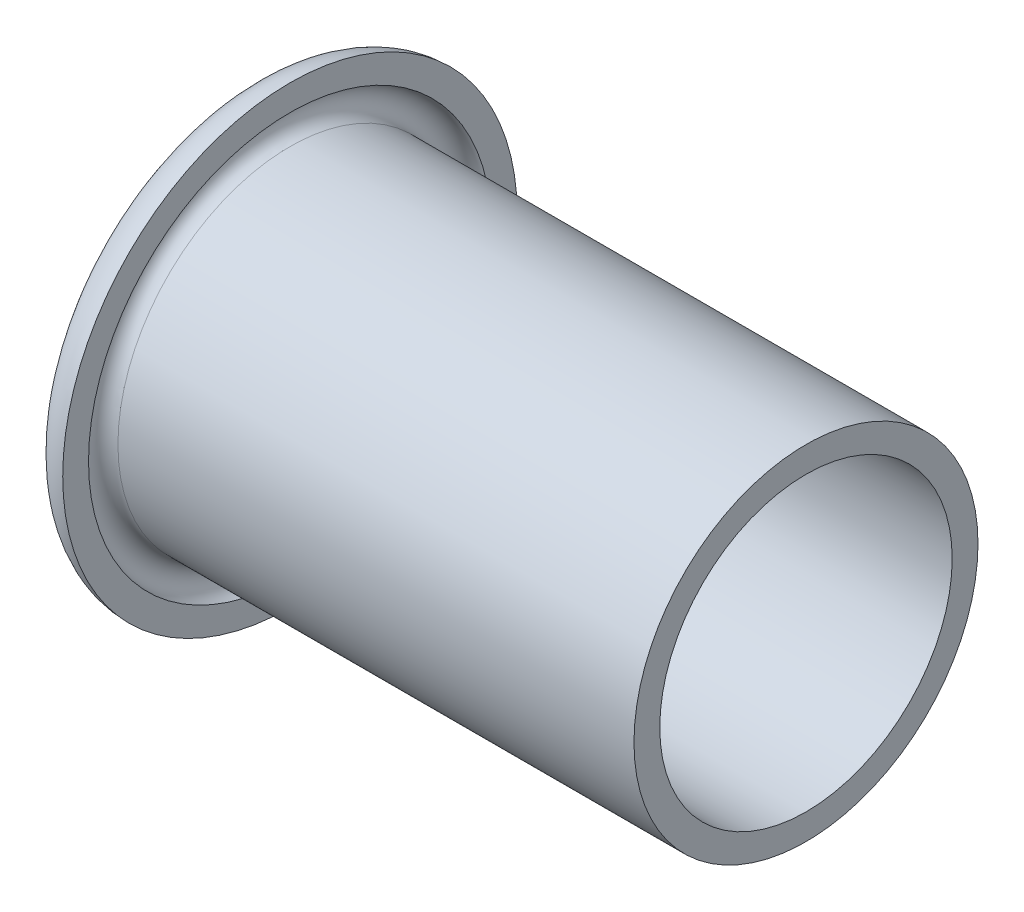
ISO-10303-21;
HEADER;
FILE_DESCRIPTION(('STEP AP214'),'2;1');
FILE_NAME('part.step','',(''),(''),'','','');
FILE_SCHEMA(('AUTOMOTIVE_DESIGN { 1 0 10303 214 1 1 1 1 }'));
ENDSEC;
DATA;
#1=APPLICATION_CONTEXT('core data for automotive mechanical design processes');
#2=APPLICATION_PROTOCOL_DEFINITION('international standard','automotive_design',2000,#1);
#3=PRODUCT_CONTEXT('',#1,'mechanical');
#4=PRODUCT('Part','Part','',(#3));
#5=PRODUCT_RELATED_PRODUCT_CATEGORY('part','',(#4));
#6=PRODUCT_DEFINITION_FORMATION('','',#4);
#7=PRODUCT_DEFINITION_CONTEXT('part definition',#1,'design');
#8=PRODUCT_DEFINITION('design','',#6,#7);
#9=PRODUCT_DEFINITION_SHAPE('','',#8);
#10=(LENGTH_UNIT() NAMED_UNIT(*) SI_UNIT(.MILLI.,.METRE.));
#11=(NAMED_UNIT(*) PLANE_ANGLE_UNIT() SI_UNIT($,.RADIAN.));
#12=(NAMED_UNIT(*) SI_UNIT($,.STERADIAN.) SOLID_ANGLE_UNIT());
#13=UNCERTAINTY_MEASURE_WITH_UNIT(LENGTH_MEASURE(1.E-05),#10,'distance_accuracy_value','');
#14=(GEOMETRIC_REPRESENTATION_CONTEXT(3) GLOBAL_UNCERTAINTY_ASSIGNED_CONTEXT((#13)) GLOBAL_UNIT_ASSIGNED_CONTEXT((#10,
#11,#12)) REPRESENTATION_CONTEXT('',''));
#15=CARTESIAN_POINT('',(0.,0.,0.));
#16=DIRECTION('',(0.,0.,1.));
#17=DIRECTION('',(1.,0.,0.));
#18=AXIS2_PLACEMENT_3D('',#15,#16,#17);
#19=CARTESIAN_POINT('',(-26.751259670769,0.,0.));
#20=DIRECTION('',(-1.,0.,0.));
#21=DIRECTION('',(0.,0.,1.));
#22=AXIS2_PLACEMENT_3D('',#19,#20,#21);
#23=CYLINDRICAL_SURFACE('',#22,10.);
#24=CARTESIAN_POINT('',(2.35500000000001,0.,0.));
#25=DIRECTION('',(-1.,0.,0.));
#26=DIRECTION('',(0.,0.,1.));
#27=AXIS2_PLACEMENT_3D('',#24,#25,#26);
#28=CIRCLE('',#27,10.);
#29=CARTESIAN_POINT('',(2.35500000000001,0.,10.));
#30=VERTEX_POINT('',#29);
#31=EDGE_CURVE('E56',#30,#30,#28,.T.);
#32=ORIENTED_EDGE('',*,*,#31,.F.);
#33=EDGE_LOOP('',(#32));
#34=FACE_BOUND('',#33,.T.);
#35=CARTESIAN_POINT('',(32.355,0.,0.));
#36=DIRECTION('',(-1.,0.,0.));
#37=DIRECTION('',(0.,0.,1.));
#38=AXIS2_PLACEMENT_3D('',#35,#36,#37);
#39=CIRCLE('',#38,10.);
#40=CARTESIAN_POINT('',(32.355,0.,10.));
#41=VERTEX_POINT('',#40);
#42=EDGE_CURVE('E10',#41,#41,#39,.T.);
#43=ORIENTED_EDGE('',*,*,#42,.T.);
#44=EDGE_LOOP('',(#43));
#45=FACE_BOUND('',#44,.T.);
#46=ADVANCED_FACE('F40',(#34,#45),#23,.T.);
#47=CARTESIAN_POINT('',(32.355,8.5,0.));
#48=DIRECTION('',(-1.,0.,0.));
#49=DIRECTION('',(0.,0.,1.));
#50=AXIS2_PLACEMENT_3D('',#47,#48,#49);
#51=PLANE('',#50);
#52=ORIENTED_EDGE('',*,*,#42,.F.);
#53=EDGE_LOOP('',(#52));
#54=FACE_BOUND('',#53,.T.);
#55=CARTESIAN_POINT('',(32.355,0.,0.));
#56=DIRECTION('',(-1.,0.,0.));
#57=DIRECTION('',(0.,0.,1.));
#58=AXIS2_PLACEMENT_3D('',#55,#56,#57);
#59=CIRCLE('',#58,8.5);
#60=CARTESIAN_POINT('',(32.355,0.,8.5));
#61=VERTEX_POINT('',#60);
#62=EDGE_CURVE('E43',#61,#61,#59,.T.);
#63=ORIENTED_EDGE('',*,*,#62,.T.);
#64=EDGE_LOOP('',(#63));
#65=FACE_BOUND('',#64,.T.);
#66=ADVANCED_FACE('F68',(#54,#65),#51,.F.);
#67=CARTESIAN_POINT('',(-26.751259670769,0.,0.));
#68=DIRECTION('',(-1.,0.,0.));
#69=DIRECTION('',(0.,0.,1.));
#70=AXIS2_PLACEMENT_3D('',#67,#68,#69);
#71=CYLINDRICAL_SURFACE('',#70,8.5);
#72=ORIENTED_EDGE('',*,*,#62,.F.);
#73=EDGE_LOOP('',(#72));
#74=FACE_BOUND('',#73,.T.);
#75=CARTESIAN_POINT('',(2.35500000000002,0.,0.));
#76=DIRECTION('',(-1.,0.,0.));
#77=DIRECTION('',(0.,0.,1.));
#78=AXIS2_PLACEMENT_3D('',#75,#76,#77);
#79=CIRCLE('',#78,8.5);
#80=CARTESIAN_POINT('',(2.35500000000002,0.,8.5));
#81=VERTEX_POINT('',#80);
#82=EDGE_CURVE('E50',#81,#81,#79,.T.);
#83=ORIENTED_EDGE('',*,*,#82,.T.);
#84=EDGE_LOOP('',(#83));
#85=FACE_BOUND('',#84,.T.);
#86=ADVANCED_FACE('F66',(#74,#85),#71,.F.);
#87=CARTESIAN_POINT('',(2.35500000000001,0.,0.));
#88=DIRECTION('',(-1.,0.,0.));
#89=DIRECTION('',(0.,0.,1.));
#90=AXIS2_PLACEMENT_3D('',#87,#88,#89);
#91=TOROIDAL_SURFACE('',#90,10.855,2.355);
#92=ORIENTED_EDGE('',*,*,#82,.F.);
#93=EDGE_LOOP('',(#92));
#94=FACE_BOUND('',#93,.T.);
#95=CARTESIAN_POINT('',(2.35500000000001,0.,0.));
#96=DIRECTION('',(-1.,0.,0.));
#97=DIRECTION('',(0.,0.,1.));
#98=AXIS2_PLACEMENT_3D('',#95,#96,#97);
#99=CIRCLE('',#98,13.21);
#100=CARTESIAN_POINT('',(2.35500000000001,0.,13.21));
#101=VERTEX_POINT('',#100);
#102=EDGE_CURVE('E51',#101,#101,#99,.T.);
#103=ORIENTED_EDGE('',*,*,#102,.T.);
#104=EDGE_LOOP('',(#103));
#105=FACE_BOUND('',#104,.T.);
#106=ADVANCED_FACE('F72',(#94,#105),#91,.T.);
#107=CARTESIAN_POINT('',(2.35500000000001,11.71,0.));
#108=DIRECTION('',(-1.,0.,0.));
#109=DIRECTION('',(0.,0.,1.));
#110=AXIS2_PLACEMENT_3D('',#107,#108,#109);
#111=PLANE('',#110);
#112=ORIENTED_EDGE('',*,*,#102,.F.);
#113=EDGE_LOOP('',(#112));
#114=FACE_BOUND('',#113,.T.);
#115=CARTESIAN_POINT('',(2.35500000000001,0.,0.));
#116=DIRECTION('',(-1.,0.,0.));
#117=DIRECTION('',(0.,0.,1.));
#118=AXIS2_PLACEMENT_3D('',#115,#116,#117);
#119=CIRCLE('',#118,11.71);
#120=CARTESIAN_POINT('',(2.35500000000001,0.,11.71));
#121=VERTEX_POINT('',#120);
#122=EDGE_CURVE('E57',#121,#121,#119,.T.);
#123=ORIENTED_EDGE('',*,*,#122,.T.);
#124=EDGE_LOOP('',(#123));
#125=FACE_BOUND('',#124,.T.);
#126=ADVANCED_FACE('F82',(#114,#125),#111,.F.);
#127=CARTESIAN_POINT('',(2.35500000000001,0.,0.));
#128=DIRECTION('',(-1.,0.,0.));
#129=DIRECTION('',(0.,0.,1.));
#130=AXIS2_PLACEMENT_3D('',#127,#128,#129);
#131=TOROIDAL_SURFACE('',#130,10.855,0.855000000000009);
#132=ORIENTED_EDGE('',*,*,#122,.F.);
#133=EDGE_LOOP('',(#132));
#134=FACE_BOUND('',#133,.T.);
#135=ORIENTED_EDGE('',*,*,#31,.T.);
#136=EDGE_LOOP('',(#135));
#137=FACE_BOUND('',#136,.T.);
#138=ADVANCED_FACE('F64',(#134,#137),#131,.F.);
#139=CLOSED_SHELL('',(#46,#66,#86,#106,#126,#138));
#140=MANIFOLD_SOLID_BREP('B2',#139);
#141=ADVANCED_BREP_SHAPE_REPRESENTATION('',(#18,#140),#14);
#142=SHAPE_DEFINITION_REPRESENTATION(#9,#141);
ENDSEC;
END-ISO-10303-21;
